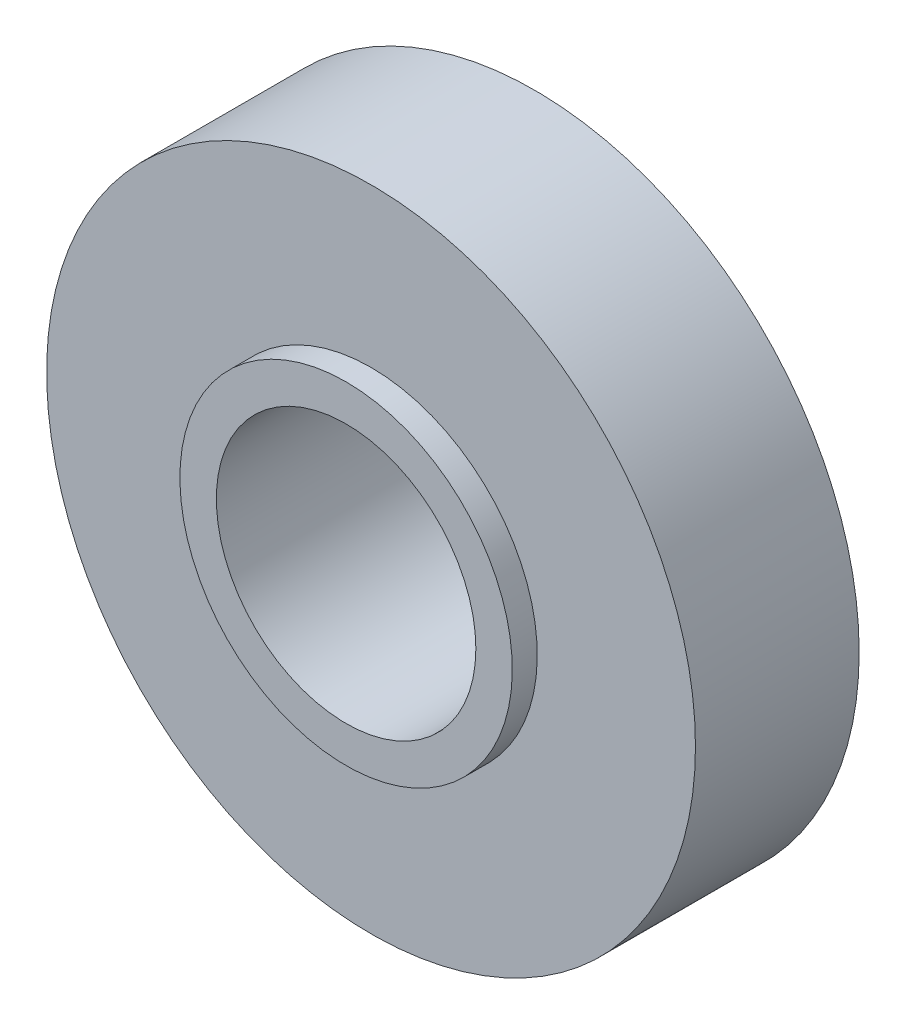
ISO-10303-21;
HEADER;
FILE_DESCRIPTION(('STEP AP214'),'2;1');
FILE_NAME('part.step','',(''),(''),'','','');
FILE_SCHEMA(('AUTOMOTIVE_DESIGN { 1 0 10303 214 1 1 1 1 }'));
ENDSEC;
DATA;
#1=APPLICATION_CONTEXT('core data for automotive mechanical design processes');
#2=APPLICATION_PROTOCOL_DEFINITION('international standard','automotive_design',2000,#1);
#3=PRODUCT_CONTEXT('',#1,'mechanical');
#4=PRODUCT('Part','Part','',(#3));
#5=PRODUCT_RELATED_PRODUCT_CATEGORY('part','',(#4));
#6=PRODUCT_DEFINITION_FORMATION('','',#4);
#7=PRODUCT_DEFINITION_CONTEXT('part definition',#1,'design');
#8=PRODUCT_DEFINITION('design','',#6,#7);
#9=PRODUCT_DEFINITION_SHAPE('','',#8);
#10=(LENGTH_UNIT() NAMED_UNIT(*) SI_UNIT(.MILLI.,.METRE.));
#11=(NAMED_UNIT(*) PLANE_ANGLE_UNIT() SI_UNIT($,.RADIAN.));
#12=(NAMED_UNIT(*) SI_UNIT($,.STERADIAN.) SOLID_ANGLE_UNIT());
#13=UNCERTAINTY_MEASURE_WITH_UNIT(LENGTH_MEASURE(1.E-05),#10,'distance_accuracy_value','');
#14=(GEOMETRIC_REPRESENTATION_CONTEXT(3) GLOBAL_UNCERTAINTY_ASSIGNED_CONTEXT((#13)) GLOBAL_UNIT_ASSIGNED_CONTEXT((#10,
#11,#12)) REPRESENTATION_CONTEXT('',''));
#15=CARTESIAN_POINT('',(0.,0.,0.));
#16=DIRECTION('',(0.,0.,1.));
#17=DIRECTION('',(1.,0.,0.));
#18=AXIS2_PLACEMENT_3D('',#15,#16,#17);
#19=CARTESIAN_POINT('',(0.,0.,94.6));
#20=DIRECTION('',(0.,0.,-1.));
#21=DIRECTION('',(0.,1.,0.));
#22=AXIS2_PLACEMENT_3D('',#19,#20,#21);
#23=CYLINDRICAL_SURFACE('',#22,65.);
#24=CARTESIAN_POINT('',(0.,0.,94.5));
#25=DIRECTION('',(0.,0.,-1.));
#26=DIRECTION('',(0.,1.,0.));
#27=AXIS2_PLACEMENT_3D('',#24,#25,#26);
#28=CIRCLE('',#27,65.);
#29=CARTESIAN_POINT('',(65.,0.,94.5));
#30=VERTEX_POINT('',#29);
#31=EDGE_CURVE('E24',#30,#30,#28,.T.);
#32=ORIENTED_EDGE('',*,*,#31,.F.);
#33=DIRECTION('',(0.,0.,-1.));
#34=VECTOR('',#33,1.);
#35=CARTESIAN_POINT('',(65.,0.,47.25));
#36=LINE('',#35,#34);
#37=CARTESIAN_POINT('',(65.,0.,0.));
#38=VERTEX_POINT('',#37);
#39=EDGE_CURVE('E9',#30,#38,#36,.T.);
#40=ORIENTED_EDGE('',*,*,#39,.T.);
#41=CARTESIAN_POINT('',(0.,0.,0.));
#42=DIRECTION('',(0.,0.,1.));
#43=DIRECTION('',(1.,0.,0.));
#44=AXIS2_PLACEMENT_3D('',#41,#42,#43);
#45=CIRCLE('',#44,65.);
#46=EDGE_CURVE('E18',#38,#38,#45,.T.);
#47=ORIENTED_EDGE('',*,*,#46,.F.);
#48=ORIENTED_EDGE('',*,*,#39,.F.);
#49=EDGE_LOOP('',(#32,#40,#47,#48));
#50=FACE_BOUND('',#49,.T.);
#51=ADVANCED_FACE('F14',(#50),#23,.F.);
#52=CARTESIAN_POINT('',(87.4124988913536,87.4124988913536,94.5));
#53=DIRECTION('',(0.,0.,1.));
#54=DIRECTION('',(-1.,0.,0.));
#55=AXIS2_PLACEMENT_3D('',#52,#53,#54);
#56=PLANE('',#55);
#57=ORIENTED_EDGE('',*,*,#31,.T.);
#58=EDGE_LOOP('',(#57));
#59=FACE_BOUND('',#58,.T.);
#60=CARTESIAN_POINT('',(0.,1.59594559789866E-13,94.5));
#61=DIRECTION('',(0.,0.,-1.));
#62=DIRECTION('',(-1.,0.,0.));
#63=AXIS2_PLACEMENT_3D('',#60,#61,#62);
#64=CIRCLE('',#63,83.25);
#65=CARTESIAN_POINT('',(0.,83.2500000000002,94.5));
#66=VERTEX_POINT('',#65);
#67=EDGE_CURVE('E68',#66,#66,#64,.T.);
#68=ORIENTED_EDGE('',*,*,#67,.F.);
#69=EDGE_LOOP('',(#68));
#70=FACE_BOUND('',#69,.T.);
#71=ADVANCED_FACE('F66',(#59,#70),#56,.T.);
#72=CARTESIAN_POINT('',(0.,1.35308431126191E-13,82.));
#73=DIRECTION('',(0.,0.,1.));
#74=DIRECTION('',(1.,0.,0.));
#75=AXIS2_PLACEMENT_3D('',#72,#73,#74);
#76=CYLINDRICAL_SURFACE('',#75,83.25);
#77=CARTESIAN_POINT('',(0.,1.59594559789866E-13,82.));
#78=DIRECTION('',(0.,0.,-1.));
#79=DIRECTION('',(-1.,0.,0.));
#80=AXIS2_PLACEMENT_3D('',#77,#78,#79);
#81=CIRCLE('',#80,83.25);
#82=CARTESIAN_POINT('',(0.,83.2500000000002,82.));
#83=VERTEX_POINT('',#82);
#84=EDGE_CURVE('E47',#83,#83,#81,.T.);
#85=ORIENTED_EDGE('',*,*,#84,.F.);
#86=DIRECTION('',(0.,0.,-1.));
#87=VECTOR('',#86,1.);
#88=CARTESIAN_POINT('',(0.,83.2500000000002,88.25));
#89=LINE('',#88,#87);
#90=EDGE_CURVE('E43',#66,#83,#89,.T.);
#91=ORIENTED_EDGE('',*,*,#90,.F.);
#92=ORIENTED_EDGE('',*,*,#67,.T.);
#93=ORIENTED_EDGE('',*,*,#90,.T.);
#94=EDGE_LOOP('',(#85,#91,#92,#93));
#95=FACE_BOUND('',#94,.T.);
#96=ADVANCED_FACE('F71',(#95),#76,.T.);
#97=CARTESIAN_POINT('',(170.624986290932,-170.624986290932,82.));
#98=DIRECTION('',(0.,0.,1.));
#99=DIRECTION('',(0.,1.,0.));
#100=AXIS2_PLACEMENT_3D('',#97,#98,#99);
#101=PLANE('',#100);
#102=ORIENTED_EDGE('',*,*,#84,.T.);
#103=EDGE_LOOP('',(#102));
#104=FACE_BOUND('',#103,.T.);
#105=CARTESIAN_POINT('',(1.2490009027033E-13,1.31340794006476E-13,82.));
#106=DIRECTION('',(0.,0.,-1.));
#107=DIRECTION('',(0.,1.,0.));
#108=AXIS2_PLACEMENT_3D('',#105,#106,#107);
#109=CIRCLE('',#108,162.5);
#110=CARTESIAN_POINT('',(162.5,0.,82.));
#111=VERTEX_POINT('',#110);
#112=EDGE_CURVE('E58',#111,#111,#109,.T.);
#113=ORIENTED_EDGE('',*,*,#112,.F.);
#114=EDGE_LOOP('',(#113));
#115=FACE_BOUND('',#114,.T.);
#116=ADVANCED_FACE('F73',(#104,#115),#101,.T.);
#117=CARTESIAN_POINT('',(0.,0.,0.));
#118=DIRECTION('',(0.,0.,1.));
#119=DIRECTION('',(1.,0.,0.));
#120=AXIS2_PLACEMENT_3D('',#117,#118,#119);
#121=CYLINDRICAL_SURFACE('',#120,162.5);
#122=CARTESIAN_POINT('',(0.,0.,0.));
#123=DIRECTION('',(0.,0.,1.));
#124=DIRECTION('',(1.,0.,0.));
#125=AXIS2_PLACEMENT_3D('',#122,#123,#124);
#126=CIRCLE('',#125,162.5);
#127=CARTESIAN_POINT('',(162.5,0.,0.));
#128=VERTEX_POINT('',#127);
#129=EDGE_CURVE('E57',#128,#128,#126,.T.);
#130=ORIENTED_EDGE('',*,*,#129,.T.);
#131=DIRECTION('',(0.,0.,-1.));
#132=VECTOR('',#131,1.);
#133=CARTESIAN_POINT('',(162.5,0.,41.));
#134=LINE('',#133,#132);
#135=EDGE_CURVE('E53',#111,#128,#134,.T.);
#136=ORIENTED_EDGE('',*,*,#135,.F.);
#137=ORIENTED_EDGE('',*,*,#112,.T.);
#138=ORIENTED_EDGE('',*,*,#135,.T.);
#139=EDGE_LOOP('',(#130,#136,#137,#138));
#140=FACE_BOUND('',#139,.T.);
#141=ADVANCED_FACE('F76',(#140),#121,.T.);
#142=CARTESIAN_POINT('',(-170.624986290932,170.624986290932,0.));
#143=DIRECTION('',(0.,0.,-1.));
#144=DIRECTION('',(1.,0.,0.));
#145=AXIS2_PLACEMENT_3D('',#142,#143,#144);
#146=PLANE('',#145);
#147=ORIENTED_EDGE('',*,*,#46,.T.);
#148=EDGE_LOOP('',(#147));
#149=FACE_BOUND('',#148,.T.);
#150=ORIENTED_EDGE('',*,*,#129,.F.);
#151=EDGE_LOOP('',(#150));
#152=FACE_BOUND('',#151,.T.);
#153=ADVANCED_FACE('F16',(#149,#152),#146,.T.);
#154=CLOSED_SHELL('',(#51,#71,#96,#116,#141,#153));
#155=MANIFOLD_SOLID_BREP('B1',#154);
#156=ADVANCED_BREP_SHAPE_REPRESENTATION('',(#18,#155),#14);
#157=SHAPE_DEFINITION_REPRESENTATION(#9,#156);
ENDSEC;
END-ISO-10303-21;
